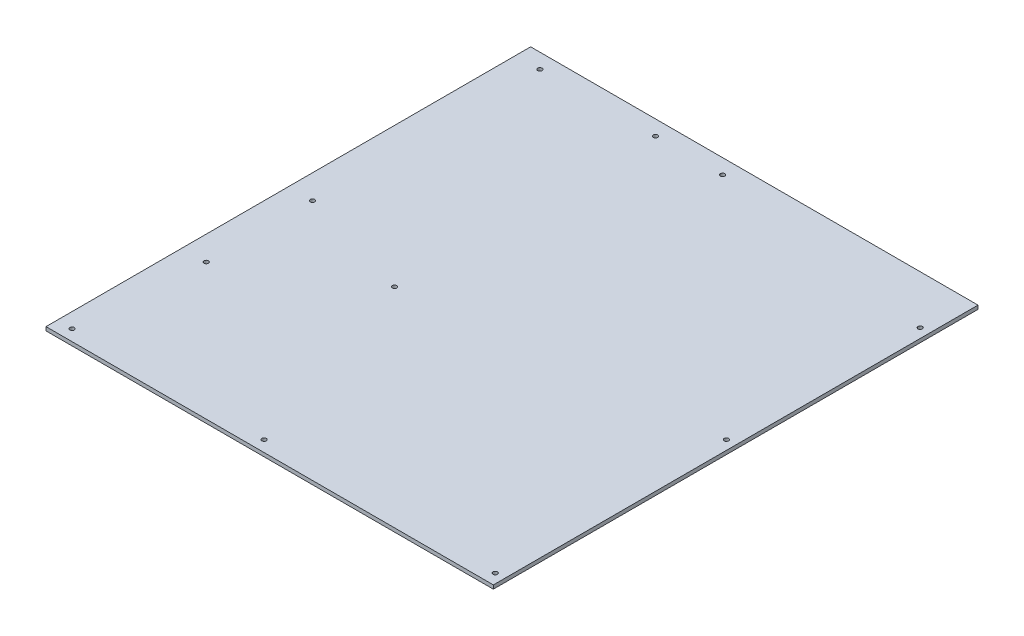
ISO-10303-21;
HEADER;
FILE_DESCRIPTION(('STEP AP214'),'2;1');
FILE_NAME('part.step','',(''),(''),'','','');
FILE_SCHEMA(('AUTOMOTIVE_DESIGN { 1 0 10303 214 1 1 1 1 }'));
ENDSEC;
DATA;
#1=APPLICATION_CONTEXT('core data for automotive mechanical design processes');
#2=APPLICATION_PROTOCOL_DEFINITION('international standard','automotive_design',2000,#1);
#3=PRODUCT_CONTEXT('',#1,'mechanical');
#4=PRODUCT('Part','Part','',(#3));
#5=PRODUCT_RELATED_PRODUCT_CATEGORY('part','',(#4));
#6=PRODUCT_DEFINITION_FORMATION('','',#4);
#7=PRODUCT_DEFINITION_CONTEXT('part definition',#1,'design');
#8=PRODUCT_DEFINITION('design','',#6,#7);
#9=PRODUCT_DEFINITION_SHAPE('','',#8);
#10=(LENGTH_UNIT() NAMED_UNIT(*) SI_UNIT(.MILLI.,.METRE.));
#11=(NAMED_UNIT(*) PLANE_ANGLE_UNIT() SI_UNIT($,.RADIAN.));
#12=(NAMED_UNIT(*) SI_UNIT($,.STERADIAN.) SOLID_ANGLE_UNIT());
#13=UNCERTAINTY_MEASURE_WITH_UNIT(LENGTH_MEASURE(1.E-05),#10,'distance_accuracy_value','');
#14=(GEOMETRIC_REPRESENTATION_CONTEXT(3) GLOBAL_UNCERTAINTY_ASSIGNED_CONTEXT((#13)) GLOBAL_UNIT_ASSIGNED_CONTEXT((#10,
#11,#12)) REPRESENTATION_CONTEXT('',''));
#15=CARTESIAN_POINT('',(0.,0.,0.));
#16=DIRECTION('',(0.,0.,1.));
#17=DIRECTION('',(1.,0.,0.));
#18=AXIS2_PLACEMENT_3D('',#15,#16,#17);
#19=CARTESIAN_POINT('',(-152.4,2.54,0.));
#20=DIRECTION('',(1.,0.,0.));
#21=DIRECTION('',(0.,0.,-1.));
#22=AXIS2_PLACEMENT_3D('',#19,#20,#21);
#23=PLANE('',#22);
#24=DIRECTION('',(0.,0.,1.));
#25=VECTOR('',#24,1.);
#26=CARTESIAN_POINT('',(-152.4,0.,0.));
#27=LINE('',#26,#25);
#28=CARTESIAN_POINT('',(-152.4,0.,-330.2));
#29=VERTEX_POINT('',#28);
#30=CARTESIAN_POINT('',(-152.4,0.,0.));
#31=VERTEX_POINT('',#30);
#32=EDGE_CURVE('E97',#29,#31,#27,.T.);
#33=ORIENTED_EDGE('',*,*,#32,.T.);
#34=DIRECTION('',(0.,-1.,0.));
#35=VECTOR('',#34,1.);
#36=CARTESIAN_POINT('',(-152.4,2.54,0.));
#37=LINE('',#36,#35);
#38=CARTESIAN_POINT('',(-152.4,2.54,0.));
#39=VERTEX_POINT('',#38);
#40=EDGE_CURVE('E11',#39,#31,#37,.T.);
#41=ORIENTED_EDGE('',*,*,#40,.F.);
#42=DIRECTION('',(0.,0.,1.));
#43=VECTOR('',#42,1.);
#44=CARTESIAN_POINT('',(-152.4,2.54,0.));
#45=LINE('',#44,#43);
#46=CARTESIAN_POINT('',(-152.4,2.54,-330.2));
#47=VERTEX_POINT('',#46);
#48=EDGE_CURVE('E84',#47,#39,#45,.T.);
#49=ORIENTED_EDGE('',*,*,#48,.F.);
#50=DIRECTION('',(0.,-1.,0.));
#51=VECTOR('',#50,1.);
#52=CARTESIAN_POINT('',(-152.4,2.54,-330.2));
#53=LINE('',#52,#51);
#54=EDGE_CURVE('E93',#47,#29,#53,.T.);
#55=ORIENTED_EDGE('',*,*,#54,.T.);
#56=EDGE_LOOP('',(#33,#41,#49,#55));
#57=FACE_BOUND('',#56,.T.);
#58=ADVANCED_FACE('F32',(#57),#23,.F.);
#59=CARTESIAN_POINT('',(-152.4,2.54,0.));
#60=DIRECTION('',(0.,0.,-1.));
#61=DIRECTION('',(-1.,0.,0.));
#62=AXIS2_PLACEMENT_3D('',#59,#60,#61);
#63=PLANE('',#62);
#64=DIRECTION('',(1.,0.,0.));
#65=VECTOR('',#64,1.);
#66=CARTESIAN_POINT('',(-152.4,0.,0.));
#67=LINE('',#66,#65);
#68=CARTESIAN_POINT('',(152.4,0.,0.));
#69=VERTEX_POINT('',#68);
#70=EDGE_CURVE('E88',#31,#69,#67,.T.);
#71=ORIENTED_EDGE('',*,*,#70,.T.);
#72=DIRECTION('',(0.,-1.,0.));
#73=VECTOR('',#72,1.);
#74=CARTESIAN_POINT('',(152.4,2.54,0.));
#75=LINE('',#74,#73);
#76=CARTESIAN_POINT('',(152.4,2.54,0.));
#77=VERTEX_POINT('',#76);
#78=EDGE_CURVE('E41',#77,#69,#75,.T.);
#79=ORIENTED_EDGE('',*,*,#78,.F.);
#80=DIRECTION('',(1.,0.,0.));
#81=VECTOR('',#80,1.);
#82=CARTESIAN_POINT('',(-152.4,2.54,0.));
#83=LINE('',#82,#81);
#84=EDGE_CURVE('E79',#39,#77,#83,.T.);
#85=ORIENTED_EDGE('',*,*,#84,.F.);
#86=ORIENTED_EDGE('',*,*,#40,.T.);
#87=EDGE_LOOP('',(#71,#79,#85,#86));
#88=FACE_BOUND('',#87,.T.);
#89=ADVANCED_FACE('F87',(#88),#63,.F.);
#90=CARTESIAN_POINT('',(152.4,2.54,0.));
#91=DIRECTION('',(-1.,0.,0.));
#92=DIRECTION('',(0.,0.,1.));
#93=AXIS2_PLACEMENT_3D('',#90,#91,#92);
#94=PLANE('',#93);
#95=DIRECTION('',(0.,0.,-1.));
#96=VECTOR('',#95,1.);
#97=CARTESIAN_POINT('',(152.4,0.,0.));
#98=LINE('',#97,#96);
#99=CARTESIAN_POINT('',(152.4,0.,-330.2));
#100=VERTEX_POINT('',#99);
#101=EDGE_CURVE('E66',#69,#100,#98,.T.);
#102=ORIENTED_EDGE('',*,*,#101,.T.);
#103=DIRECTION('',(0.,-1.,0.));
#104=VECTOR('',#103,1.);
#105=CARTESIAN_POINT('',(152.4,2.54,-330.2));
#106=LINE('',#105,#104);
#107=CARTESIAN_POINT('',(152.4,2.54,-330.2));
#108=VERTEX_POINT('',#107);
#109=EDGE_CURVE('E89',#108,#100,#106,.T.);
#110=ORIENTED_EDGE('',*,*,#109,.F.);
#111=DIRECTION('',(0.,0.,-1.));
#112=VECTOR('',#111,1.);
#113=CARTESIAN_POINT('',(152.4,2.54,0.));
#114=LINE('',#113,#112);
#115=EDGE_CURVE('E82',#77,#108,#114,.T.);
#116=ORIENTED_EDGE('',*,*,#115,.F.);
#117=ORIENTED_EDGE('',*,*,#78,.T.);
#118=EDGE_LOOP('',(#102,#110,#116,#117));
#119=FACE_BOUND('',#118,.T.);
#120=ADVANCED_FACE('F91',(#119),#94,.F.);
#121=CARTESIAN_POINT('',(-152.4,2.54,-330.2));
#122=DIRECTION('',(0.,0.,1.));
#123=DIRECTION('',(1.,0.,0.));
#124=AXIS2_PLACEMENT_3D('',#121,#122,#123);
#125=PLANE('',#124);
#126=DIRECTION('',(-1.,0.,0.));
#127=VECTOR('',#126,1.);
#128=CARTESIAN_POINT('',(-152.4,0.,-330.2));
#129=LINE('',#128,#127);
#130=EDGE_CURVE('E72',#100,#29,#129,.T.);
#131=ORIENTED_EDGE('',*,*,#130,.T.);
#132=ORIENTED_EDGE('',*,*,#54,.F.);
#133=DIRECTION('',(-1.,0.,0.));
#134=VECTOR('',#133,1.);
#135=CARTESIAN_POINT('',(-152.4,2.54,-330.2));
#136=LINE('',#135,#134);
#137=EDGE_CURVE('E49',#108,#47,#136,.T.);
#138=ORIENTED_EDGE('',*,*,#137,.F.);
#139=ORIENTED_EDGE('',*,*,#109,.T.);
#140=EDGE_LOOP('',(#131,#132,#138,#139));
#141=FACE_BOUND('',#140,.T.);
#142=ADVANCED_FACE('F105',(#141),#125,.F.);
#143=CARTESIAN_POINT('',(0.,2.54,0.));
#144=DIRECTION('',(0.,-1.,0.));
#145=DIRECTION('',(0.,0.,-1.));
#146=AXIS2_PLACEMENT_3D('',#143,#144,#145);
#147=PLANE('',#146);
#148=CARTESIAN_POINT('',(-135.89,2.54,-320.04));
#149=DIRECTION('',(0.,1.,0.));
#150=DIRECTION('',(0.,0.,1.));
#151=AXIS2_PLACEMENT_3D('',#148,#149,#150);
#152=CIRCLE('',#151,1.5);
#153=CARTESIAN_POINT('',(-135.89,2.54,-318.54));
#154=VERTEX_POINT('',#153);
#155=EDGE_CURVE('E170',#154,#154,#152,.T.);
#156=ORIENTED_EDGE('',*,*,#155,.F.);
#157=EDGE_LOOP('',(#156));
#158=FACE_BOUND('',#157,.T.);
#159=CARTESIAN_POINT('',(-135.89,2.54,-92.7100000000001));
#160=DIRECTION('',(0.,1.,0.));
#161=DIRECTION('',(0.,0.,1.));
#162=AXIS2_PLACEMENT_3D('',#159,#160,#161);
#163=CIRCLE('',#162,1.5);
#164=CARTESIAN_POINT('',(-135.89,2.54,-91.2100000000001));
#165=VERTEX_POINT('',#164);
#166=EDGE_CURVE('E167',#165,#165,#163,.T.);
#167=ORIENTED_EDGE('',*,*,#166,.F.);
#168=EDGE_LOOP('',(#167));
#169=FACE_BOUND('',#168,.T.);
#170=CARTESIAN_POINT('',(-142.24,2.54,-7.62000000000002));
#171=DIRECTION('',(0.,1.,0.));
#172=DIRECTION('',(0.,0.,1.));
#173=AXIS2_PLACEMENT_3D('',#170,#171,#172);
#174=CIRCLE('',#173,1.5);
#175=CARTESIAN_POINT('',(-142.24,2.54,-6.12000000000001));
#176=VERTEX_POINT('',#175);
#177=EDGE_CURVE('E161',#176,#176,#174,.T.);
#178=ORIENTED_EDGE('',*,*,#177,.F.);
#179=EDGE_LOOP('',(#178));
#180=FACE_BOUND('',#179,.T.);
#181=CARTESIAN_POINT('',(-57.15,2.54,-142.24));
#182=DIRECTION('',(0.,1.,0.));
#183=DIRECTION('',(0.,0.,1.));
#184=AXIS2_PLACEMENT_3D('',#181,#182,#183);
#185=CIRCLE('',#184,1.5);
#186=CARTESIAN_POINT('',(-57.15,2.54,-140.74));
#187=VERTEX_POINT('',#186);
#188=EDGE_CURVE('E155',#187,#187,#185,.T.);
#189=ORIENTED_EDGE('',*,*,#188,.F.);
#190=EDGE_LOOP('',(#189));
#191=FACE_BOUND('',#190,.T.);
#192=CARTESIAN_POINT('',(-11.43,2.54,-320.04));
#193=DIRECTION('',(0.,1.,0.));
#194=DIRECTION('',(0.,0.,1.));
#195=AXIS2_PLACEMENT_3D('',#192,#193,#194);
#196=CIRCLE('',#195,1.5);
#197=CARTESIAN_POINT('',(-11.43,2.54,-318.54));
#198=VERTEX_POINT('',#197);
#199=EDGE_CURVE('E149',#198,#198,#196,.T.);
#200=ORIENTED_EDGE('',*,*,#199,.F.);
#201=EDGE_LOOP('',(#200));
#202=FACE_BOUND('',#201,.T.);
#203=CARTESIAN_POINT('',(146.05,2.54,-297.18));
#204=DIRECTION('',(0.,1.,0.));
#205=DIRECTION('',(0.,0.,1.));
#206=AXIS2_PLACEMENT_3D('',#203,#204,#205);
#207=CIRCLE('',#206,1.5);
#208=CARTESIAN_POINT('',(146.05,2.54,-295.68));
#209=VERTEX_POINT('',#208);
#210=EDGE_CURVE('E143',#209,#209,#207,.T.);
#211=ORIENTED_EDGE('',*,*,#210,.F.);
#212=EDGE_LOOP('',(#211));
#213=FACE_BOUND('',#212,.T.);
#214=CARTESIAN_POINT('',(146.05,2.54,-165.1));
#215=DIRECTION('',(0.,1.,0.));
#216=DIRECTION('',(0.,0.,1.));
#217=AXIS2_PLACEMENT_3D('',#214,#215,#216);
#218=CIRCLE('',#217,1.5);
#219=CARTESIAN_POINT('',(146.05,2.54,-163.6));
#220=VERTEX_POINT('',#219);
#221=EDGE_CURVE('E137',#220,#220,#218,.T.);
#222=ORIENTED_EDGE('',*,*,#221,.F.);
#223=EDGE_LOOP('',(#222));
#224=FACE_BOUND('',#223,.T.);
#225=CARTESIAN_POINT('',(146.05,2.54,-7.62000000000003));
#226=DIRECTION('',(0.,1.,0.));
#227=DIRECTION('',(0.,0.,1.));
#228=AXIS2_PLACEMENT_3D('',#225,#226,#227);
#229=CIRCLE('',#228,1.5);
#230=CARTESIAN_POINT('',(146.05,2.54,-6.12000000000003));
#231=VERTEX_POINT('',#230);
#232=EDGE_CURVE('E131',#231,#231,#229,.T.);
#233=ORIENTED_EDGE('',*,*,#232,.F.);
#234=EDGE_LOOP('',(#233));
#235=FACE_BOUND('',#234,.T.);
#236=CARTESIAN_POINT('',(-57.15,2.54,-320.04));
#237=DIRECTION('',(0.,1.,0.));
#238=DIRECTION('',(0.,0.,1.));
#239=AXIS2_PLACEMENT_3D('',#236,#237,#238);
#240=CIRCLE('',#239,1.5);
#241=CARTESIAN_POINT('',(-57.15,2.54,-318.54));
#242=VERTEX_POINT('',#241);
#243=EDGE_CURVE('E125',#242,#242,#240,.T.);
#244=ORIENTED_EDGE('',*,*,#243,.F.);
#245=EDGE_LOOP('',(#244));
#246=FACE_BOUND('',#245,.T.);
#247=CARTESIAN_POINT('',(-11.43,2.54,-7.62000000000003));
#248=DIRECTION('',(0.,1.,0.));
#249=DIRECTION('',(0.,0.,1.));
#250=AXIS2_PLACEMENT_3D('',#247,#248,#249);
#251=CIRCLE('',#250,1.5);
#252=CARTESIAN_POINT('',(-11.43,2.54,-6.12000000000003));
#253=VERTEX_POINT('',#252);
#254=EDGE_CURVE('E119',#253,#253,#251,.T.);
#255=ORIENTED_EDGE('',*,*,#254,.F.);
#256=EDGE_LOOP('',(#255));
#257=FACE_BOUND('',#256,.T.);
#258=CARTESIAN_POINT('',(-135.89,2.54,-165.1));
#259=DIRECTION('',(0.,1.,0.));
#260=DIRECTION('',(0.,0.,1.));
#261=AXIS2_PLACEMENT_3D('',#258,#259,#260);
#262=CIRCLE('',#261,1.5);
#263=CARTESIAN_POINT('',(-135.89,2.54,-163.6));
#264=VERTEX_POINT('',#263);
#265=EDGE_CURVE('E113',#264,#264,#262,.T.);
#266=ORIENTED_EDGE('',*,*,#265,.F.);
#267=EDGE_LOOP('',(#266));
#268=FACE_BOUND('',#267,.T.);
#269=ORIENTED_EDGE('',*,*,#48,.T.);
#270=ORIENTED_EDGE('',*,*,#84,.T.);
#271=ORIENTED_EDGE('',*,*,#115,.T.);
#272=ORIENTED_EDGE('',*,*,#137,.T.);
#273=EDGE_LOOP('',(#269,#270,#271,#272));
#274=FACE_BOUND('',#273,.T.);
#275=ADVANCED_FACE('F80',(#158,#169,#180,#191,#202,#213,#224,#235,#246,#257,#268,#274),#147,.F.);
#276=CARTESIAN_POINT('',(0.,0.,0.));
#277=DIRECTION('',(0.,-1.,0.));
#278=DIRECTION('',(0.,0.,-1.));
#279=AXIS2_PLACEMENT_3D('',#276,#277,#278);
#280=PLANE('',#279);
#281=CARTESIAN_POINT('',(-135.89,0.,-320.04));
#282=DIRECTION('',(0.,-1.,0.));
#283=DIRECTION('',(0.,0.,-1.));
#284=AXIS2_PLACEMENT_3D('',#281,#282,#283);
#285=CIRCLE('',#284,1.5);
#286=CARTESIAN_POINT('',(-135.89,0.,-321.54));
#287=VERTEX_POINT('',#286);
#288=EDGE_CURVE('E35',#287,#287,#285,.T.);
#289=ORIENTED_EDGE('',*,*,#288,.F.);
#290=EDGE_LOOP('',(#289));
#291=FACE_BOUND('',#290,.T.);
#292=CARTESIAN_POINT('',(-135.89,0.,-92.7100000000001));
#293=DIRECTION('',(0.,-1.,0.));
#294=DIRECTION('',(0.,0.,-1.));
#295=AXIS2_PLACEMENT_3D('',#292,#293,#294);
#296=CIRCLE('',#295,1.5);
#297=CARTESIAN_POINT('',(-135.89,0.,-94.2100000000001));
#298=VERTEX_POINT('',#297);
#299=EDGE_CURVE('E164',#298,#298,#296,.T.);
#300=ORIENTED_EDGE('',*,*,#299,.F.);
#301=EDGE_LOOP('',(#300));
#302=FACE_BOUND('',#301,.T.);
#303=CARTESIAN_POINT('',(-142.24,0.,-7.62000000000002));
#304=DIRECTION('',(0.,-1.,0.));
#305=DIRECTION('',(0.,0.,-1.));
#306=AXIS2_PLACEMENT_3D('',#303,#304,#305);
#307=CIRCLE('',#306,1.5);
#308=CARTESIAN_POINT('',(-142.24,0.,-9.12000000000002));
#309=VERTEX_POINT('',#308);
#310=EDGE_CURVE('E158',#309,#309,#307,.T.);
#311=ORIENTED_EDGE('',*,*,#310,.F.);
#312=EDGE_LOOP('',(#311));
#313=FACE_BOUND('',#312,.T.);
#314=CARTESIAN_POINT('',(-57.15,0.,-142.24));
#315=DIRECTION('',(0.,-1.,0.));
#316=DIRECTION('',(0.,0.,-1.));
#317=AXIS2_PLACEMENT_3D('',#314,#315,#316);
#318=CIRCLE('',#317,1.5);
#319=CARTESIAN_POINT('',(-57.15,0.,-143.74));
#320=VERTEX_POINT('',#319);
#321=EDGE_CURVE('E152',#320,#320,#318,.T.);
#322=ORIENTED_EDGE('',*,*,#321,.F.);
#323=EDGE_LOOP('',(#322));
#324=FACE_BOUND('',#323,.T.);
#325=CARTESIAN_POINT('',(-11.43,0.,-320.04));
#326=DIRECTION('',(0.,-1.,0.));
#327=DIRECTION('',(0.,0.,-1.));
#328=AXIS2_PLACEMENT_3D('',#325,#326,#327);
#329=CIRCLE('',#328,1.5);
#330=CARTESIAN_POINT('',(-11.43,0.,-321.54));
#331=VERTEX_POINT('',#330);
#332=EDGE_CURVE('E146',#331,#331,#329,.T.);
#333=ORIENTED_EDGE('',*,*,#332,.F.);
#334=EDGE_LOOP('',(#333));
#335=FACE_BOUND('',#334,.T.);
#336=CARTESIAN_POINT('',(146.05,0.,-297.18));
#337=DIRECTION('',(0.,-1.,0.));
#338=DIRECTION('',(0.,0.,-1.));
#339=AXIS2_PLACEMENT_3D('',#336,#337,#338);
#340=CIRCLE('',#339,1.5);
#341=CARTESIAN_POINT('',(146.05,0.,-298.68));
#342=VERTEX_POINT('',#341);
#343=EDGE_CURVE('E140',#342,#342,#340,.T.);
#344=ORIENTED_EDGE('',*,*,#343,.F.);
#345=EDGE_LOOP('',(#344));
#346=FACE_BOUND('',#345,.T.);
#347=CARTESIAN_POINT('',(146.05,0.,-165.1));
#348=DIRECTION('',(0.,-1.,0.));
#349=DIRECTION('',(0.,0.,-1.));
#350=AXIS2_PLACEMENT_3D('',#347,#348,#349);
#351=CIRCLE('',#350,1.5);
#352=CARTESIAN_POINT('',(146.05,0.,-166.6));
#353=VERTEX_POINT('',#352);
#354=EDGE_CURVE('E134',#353,#353,#351,.T.);
#355=ORIENTED_EDGE('',*,*,#354,.F.);
#356=EDGE_LOOP('',(#355));
#357=FACE_BOUND('',#356,.T.);
#358=CARTESIAN_POINT('',(146.05,0.,-7.62000000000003));
#359=DIRECTION('',(0.,-1.,0.));
#360=DIRECTION('',(0.,0.,-1.));
#361=AXIS2_PLACEMENT_3D('',#358,#359,#360);
#362=CIRCLE('',#361,1.5);
#363=CARTESIAN_POINT('',(146.05,0.,-9.12000000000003));
#364=VERTEX_POINT('',#363);
#365=EDGE_CURVE('E128',#364,#364,#362,.T.);
#366=ORIENTED_EDGE('',*,*,#365,.F.);
#367=EDGE_LOOP('',(#366));
#368=FACE_BOUND('',#367,.T.);
#369=CARTESIAN_POINT('',(-57.15,0.,-320.04));
#370=DIRECTION('',(0.,-1.,0.));
#371=DIRECTION('',(0.,0.,-1.));
#372=AXIS2_PLACEMENT_3D('',#369,#370,#371);
#373=CIRCLE('',#372,1.5);
#374=CARTESIAN_POINT('',(-57.15,0.,-321.54));
#375=VERTEX_POINT('',#374);
#376=EDGE_CURVE('E122',#375,#375,#373,.T.);
#377=ORIENTED_EDGE('',*,*,#376,.F.);
#378=EDGE_LOOP('',(#377));
#379=FACE_BOUND('',#378,.T.);
#380=CARTESIAN_POINT('',(-11.43,0.,-7.62000000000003));
#381=DIRECTION('',(0.,-1.,0.));
#382=DIRECTION('',(0.,0.,-1.));
#383=AXIS2_PLACEMENT_3D('',#380,#381,#382);
#384=CIRCLE('',#383,1.5);
#385=CARTESIAN_POINT('',(-11.43,0.,-9.12000000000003));
#386=VERTEX_POINT('',#385);
#387=EDGE_CURVE('E116',#386,#386,#384,.T.);
#388=ORIENTED_EDGE('',*,*,#387,.F.);
#389=EDGE_LOOP('',(#388));
#390=FACE_BOUND('',#389,.T.);
#391=CARTESIAN_POINT('',(-135.89,0.,-165.1));
#392=DIRECTION('',(0.,-1.,0.));
#393=DIRECTION('',(0.,0.,-1.));
#394=AXIS2_PLACEMENT_3D('',#391,#392,#393);
#395=CIRCLE('',#394,1.5);
#396=CARTESIAN_POINT('',(-135.89,0.,-166.6));
#397=VERTEX_POINT('',#396);
#398=EDGE_CURVE('E100',#397,#397,#395,.T.);
#399=ORIENTED_EDGE('',*,*,#398,.F.);
#400=EDGE_LOOP('',(#399));
#401=FACE_BOUND('',#400,.T.);
#402=ORIENTED_EDGE('',*,*,#32,.F.);
#403=ORIENTED_EDGE('',*,*,#130,.F.);
#404=ORIENTED_EDGE('',*,*,#101,.F.);
#405=ORIENTED_EDGE('',*,*,#70,.F.);
#406=EDGE_LOOP('',(#402,#403,#404,#405));
#407=FACE_BOUND('',#406,.T.);
#408=ADVANCED_FACE('F108',(#291,#302,#313,#324,#335,#346,#357,#368,#379,#390,#401,#407),#280,.T.);
#409=CARTESIAN_POINT('',(-135.89,2.54,-165.1));
#410=DIRECTION('',(0.,1.,0.));
#411=DIRECTION('',(0.,0.,1.));
#412=AXIS2_PLACEMENT_3D('',#409,#410,#411);
#413=CYLINDRICAL_SURFACE('',#412,1.5);
#414=ORIENTED_EDGE('',*,*,#398,.T.);
#415=EDGE_LOOP('',(#414));
#416=FACE_BOUND('',#415,.T.);
#417=ORIENTED_EDGE('',*,*,#265,.T.);
#418=EDGE_LOOP('',(#417));
#419=FACE_BOUND('',#418,.T.);
#420=ADVANCED_FACE('F181',(#416,#419),#413,.F.);
#421=CARTESIAN_POINT('',(-11.43,2.54,-7.62000000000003));
#422=DIRECTION('',(0.,1.,0.));
#423=DIRECTION('',(0.,0.,1.));
#424=AXIS2_PLACEMENT_3D('',#421,#422,#423);
#425=CYLINDRICAL_SURFACE('',#424,1.5);
#426=ORIENTED_EDGE('',*,*,#387,.T.);
#427=EDGE_LOOP('',(#426));
#428=FACE_BOUND('',#427,.T.);
#429=ORIENTED_EDGE('',*,*,#254,.T.);
#430=EDGE_LOOP('',(#429));
#431=FACE_BOUND('',#430,.T.);
#432=ADVANCED_FACE('F205',(#428,#431),#425,.F.);
#433=CARTESIAN_POINT('',(-57.15,2.54,-320.04));
#434=DIRECTION('',(0.,1.,0.));
#435=DIRECTION('',(0.,0.,1.));
#436=AXIS2_PLACEMENT_3D('',#433,#434,#435);
#437=CYLINDRICAL_SURFACE('',#436,1.5);
#438=ORIENTED_EDGE('',*,*,#376,.T.);
#439=EDGE_LOOP('',(#438));
#440=FACE_BOUND('',#439,.T.);
#441=ORIENTED_EDGE('',*,*,#243,.T.);
#442=EDGE_LOOP('',(#441));
#443=FACE_BOUND('',#442,.T.);
#444=ADVANCED_FACE('F256',(#440,#443),#437,.F.);
#445=CARTESIAN_POINT('',(146.05,2.54,-7.62000000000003));
#446=DIRECTION('',(0.,1.,0.));
#447=DIRECTION('',(0.,0.,1.));
#448=AXIS2_PLACEMENT_3D('',#445,#446,#447);
#449=CYLINDRICAL_SURFACE('',#448,1.5);
#450=ORIENTED_EDGE('',*,*,#365,.T.);
#451=EDGE_LOOP('',(#450));
#452=FACE_BOUND('',#451,.T.);
#453=ORIENTED_EDGE('',*,*,#232,.T.);
#454=EDGE_LOOP('',(#453));
#455=FACE_BOUND('',#454,.T.);
#456=ADVANCED_FACE('F266',(#452,#455),#449,.F.);
#457=CARTESIAN_POINT('',(146.05,2.54,-165.1));
#458=DIRECTION('',(0.,1.,0.));
#459=DIRECTION('',(0.,0.,1.));
#460=AXIS2_PLACEMENT_3D('',#457,#458,#459);
#461=CYLINDRICAL_SURFACE('',#460,1.5);
#462=ORIENTED_EDGE('',*,*,#354,.T.);
#463=EDGE_LOOP('',(#462));
#464=FACE_BOUND('',#463,.T.);
#465=ORIENTED_EDGE('',*,*,#221,.T.);
#466=EDGE_LOOP('',(#465));
#467=FACE_BOUND('',#466,.T.);
#468=ADVANCED_FACE('F276',(#464,#467),#461,.F.);
#469=CARTESIAN_POINT('',(146.05,2.54,-297.18));
#470=DIRECTION('',(0.,1.,0.));
#471=DIRECTION('',(0.,0.,1.));
#472=AXIS2_PLACEMENT_3D('',#469,#470,#471);
#473=CYLINDRICAL_SURFACE('',#472,1.5);
#474=ORIENTED_EDGE('',*,*,#343,.T.);
#475=EDGE_LOOP('',(#474));
#476=FACE_BOUND('',#475,.T.);
#477=ORIENTED_EDGE('',*,*,#210,.T.);
#478=EDGE_LOOP('',(#477));
#479=FACE_BOUND('',#478,.T.);
#480=ADVANCED_FACE('F286',(#476,#479),#473,.F.);
#481=CARTESIAN_POINT('',(-11.43,2.54,-320.04));
#482=DIRECTION('',(0.,1.,0.));
#483=DIRECTION('',(0.,0.,1.));
#484=AXIS2_PLACEMENT_3D('',#481,#482,#483);
#485=CYLINDRICAL_SURFACE('',#484,1.5);
#486=ORIENTED_EDGE('',*,*,#332,.T.);
#487=EDGE_LOOP('',(#486));
#488=FACE_BOUND('',#487,.T.);
#489=ORIENTED_EDGE('',*,*,#199,.T.);
#490=EDGE_LOOP('',(#489));
#491=FACE_BOUND('',#490,.T.);
#492=ADVANCED_FACE('F296',(#488,#491),#485,.F.);
#493=CARTESIAN_POINT('',(-57.15,2.54,-142.24));
#494=DIRECTION('',(0.,1.,0.));
#495=DIRECTION('',(0.,0.,1.));
#496=AXIS2_PLACEMENT_3D('',#493,#494,#495);
#497=CYLINDRICAL_SURFACE('',#496,1.5);
#498=ORIENTED_EDGE('',*,*,#321,.T.);
#499=EDGE_LOOP('',(#498));
#500=FACE_BOUND('',#499,.T.);
#501=ORIENTED_EDGE('',*,*,#188,.T.);
#502=EDGE_LOOP('',(#501));
#503=FACE_BOUND('',#502,.T.);
#504=ADVANCED_FACE('F306',(#500,#503),#497,.F.);
#505=CARTESIAN_POINT('',(-142.24,2.54,-7.62000000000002));
#506=DIRECTION('',(0.,1.,0.));
#507=DIRECTION('',(0.,0.,1.));
#508=AXIS2_PLACEMENT_3D('',#505,#506,#507);
#509=CYLINDRICAL_SURFACE('',#508,1.5);
#510=ORIENTED_EDGE('',*,*,#310,.T.);
#511=EDGE_LOOP('',(#510));
#512=FACE_BOUND('',#511,.T.);
#513=ORIENTED_EDGE('',*,*,#177,.T.);
#514=EDGE_LOOP('',(#513));
#515=FACE_BOUND('',#514,.T.);
#516=ADVANCED_FACE('F316',(#512,#515),#509,.F.);
#517=CARTESIAN_POINT('',(-135.89,2.54,-92.7100000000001));
#518=DIRECTION('',(0.,1.,0.));
#519=DIRECTION('',(0.,0.,1.));
#520=AXIS2_PLACEMENT_3D('',#517,#518,#519);
#521=CYLINDRICAL_SURFACE('',#520,1.5);
#522=ORIENTED_EDGE('',*,*,#299,.T.);
#523=EDGE_LOOP('',(#522));
#524=FACE_BOUND('',#523,.T.);
#525=ORIENTED_EDGE('',*,*,#166,.T.);
#526=EDGE_LOOP('',(#525));
#527=FACE_BOUND('',#526,.T.);
#528=ADVANCED_FACE('F326',(#524,#527),#521,.F.);
#529=CARTESIAN_POINT('',(-135.89,2.54,-320.04));
#530=DIRECTION('',(0.,1.,0.));
#531=DIRECTION('',(0.,0.,1.));
#532=AXIS2_PLACEMENT_3D('',#529,#530,#531);
#533=CYLINDRICAL_SURFACE('',#532,1.5);
#534=ORIENTED_EDGE('',*,*,#288,.T.);
#535=EDGE_LOOP('',(#534));
#536=FACE_BOUND('',#535,.T.);
#537=ORIENTED_EDGE('',*,*,#155,.T.);
#538=EDGE_LOOP('',(#537));
#539=FACE_BOUND('',#538,.T.);
#540=ADVANCED_FACE('F177',(#536,#539),#533,.F.);
#541=CLOSED_SHELL('',(#58,#89,#120,#142,#275,#408,#420,#432,#444,#456,#468,#480,#492,#504,#516,
#528,#540));
#542=MANIFOLD_SOLID_BREP('B2',#541);
#543=ADVANCED_BREP_SHAPE_REPRESENTATION('',(#18,#542),#14);
#544=SHAPE_DEFINITION_REPRESENTATION(#9,#543);
ENDSEC;
END-ISO-10303-21;
